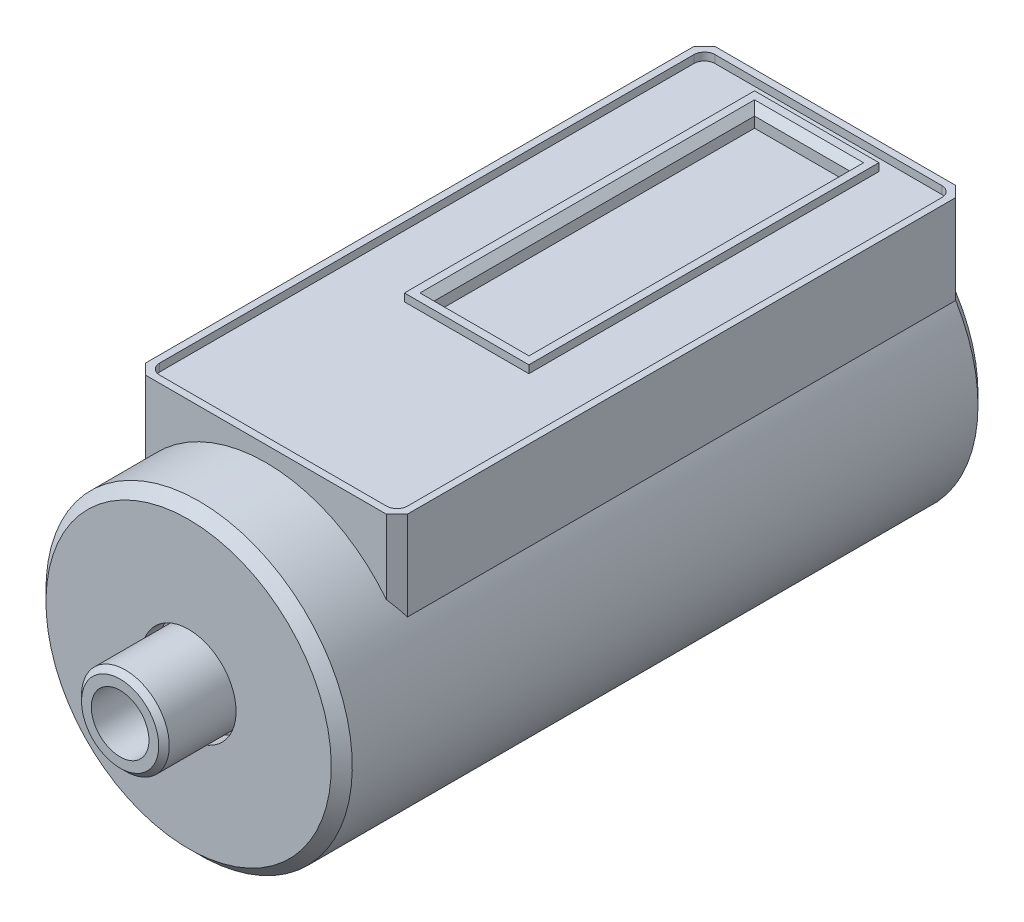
from build123d import *

# Parameters (mm, degrees)
EXTRUDE1_DEPTH     = 12.19
CHAMFER1_SIZE      = 0.76
SKETCH4_W          = 8.99
SKETCH4_H          = 25.3
CUT_EXTRUDE1_DEPTH = 0.56
SKETCH5_W          = 6.86
SKETCH5_H          = 23.16
CUT_EXTRUDE2_DEPTH = 1.27
CHAMFER2_SIZE      = 0.51
HOLE1_D            = 4.1656
HOLE1_DEPTH        = 6.35
HOLE1_TIP          = 1.251472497


with BuildPart() as part:
    # Sketch2 → Revolve1 (revolve)
    with BuildSketch(Plane(origin=(0, 0, 0), x_dir=(0, 0, -1), z_dir=(1, 0, 0))):
        Polygon((24.31, 0), (24.31, 2.79), (24.69, 3.17), (30.53, 3.17), (30.53, 3.43), (29.26, 3.43), (29.26, 10.31), (30.02, 11.07), (76, 11.07), (76, 0), align=None)
    revolve(axis=Axis((0, 0, -76), (0, 0, 1)))

    # Sketch3 → Extrude1 (add)
    with BuildSketch(Plane(origin=(0, 0, 0), x_dir=(1, 0, 0), z_dir=(0, 1, 0))):
        Polygon((-9.46, 76), (9.46, 76), (9.46, 35.61), (8.7, 34.85), (-8.7, 34.85), (-9.46, 35.61), align=None)
    extrude(amount=EXTRUDE1_DEPTH)

    # Chamfer1
    chamfer1_edges = [part.edges().sort_by_distance(p)[0] for p in [
        (0, -11.07, -76),
        (-9.46, 8.969599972, -76),
        (9.46, 8.969599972, -76),
    ]]
    chamfer(chamfer1_edges, length=CHAMFER1_SIZE)

    # Sketch4 → Cut-Extrude1 (cut)
    with BuildSketch(Plane(origin=(0, 12.19, 0), x_dir=(1, 0, 0), z_dir=(0, 1, 0))):
        with BuildLine():
            Line((-8.19, 75.49), (8.2, 75.49))
            ThreePointArc((8.2, 75.49), (8.737401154, 75.267401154), (8.96, 74.73))
            Line((8.96, 74.73), (8.96, 36.12))
            ThreePointArc((8.96, 36.12), (8.737401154, 35.582598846), (8.2, 35.36))
            Line((8.2, 35.36), (-8.19, 35.36))
            ThreePointArc((-8.19, 35.36), (-8.727401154, 35.582598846), (-8.95, 36.12))
            Line((-8.95, 36.12), (-8.95, 74.73))
            ThreePointArc((-8.95, 74.73), (-8.727401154, 75.267401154), (-8.19, 75.49))
        make_face()
        with Locations((0.005, 62)):
            Rectangle(SKETCH4_W, SKETCH4_H, mode=Mode.SUBTRACT)
    extrude(amount=-CUT_EXTRUDE1_DEPTH, mode=Mode.SUBTRACT)

    # Sketch5 → Cut-Extrude2 (cut)
    with BuildSketch(Plane(origin=(0, 12.19, 0), x_dir=(1, 0, 0), z_dir=(0, 1, 0))):
        with Locations((0.01, 62)):
            Rectangle(SKETCH5_W, SKETCH5_H)
    extrude(amount=-CUT_EXTRUDE2_DEPTH, mode=Mode.SUBTRACT)

    # Chamfer2
    chamfer2_edges = [part.edges().sort_by_distance(p)[0] for p in [
        (-3.42, 12.19, -62),
        (0.01, 12.19, -50.42),
        (3.44, 12.19, -62),
        (0.01, 12.19, -73.58),
    ]]
    chamfer(chamfer2_edges, length=CHAMFER2_SIZE)

    # Hole1
    with Locations(Plane.XY.offset(-24.31)):
        with Locations((0, 0)):
            Hole(HOLE1_D / 2, depth=HOLE1_DEPTH)
            with Locations((0, 0, -(HOLE1_DEPTH + HOLE1_TIP / 2))):  # 118° drill point
                Cone(0, HOLE1_D / 2, HOLE1_TIP, mode=Mode.SUBTRACT)


solid = part.part
